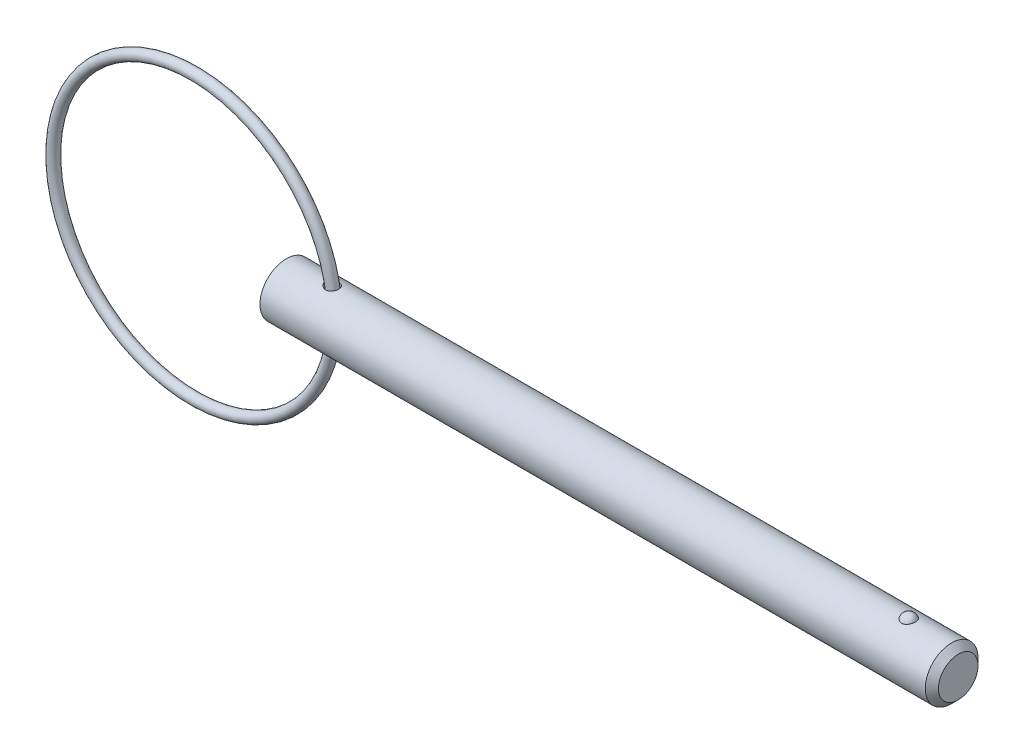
ISO-10303-21;
HEADER;
FILE_DESCRIPTION(('STEP AP214'),'2;1');
FILE_NAME('part.step','',(''),(''),'','','');
FILE_SCHEMA(('AUTOMOTIVE_DESIGN { 1 0 10303 214 1 1 1 1 }'));
ENDSEC;
DATA;
#1=APPLICATION_CONTEXT('core data for automotive mechanical design processes');
#2=APPLICATION_PROTOCOL_DEFINITION('international standard','automotive_design',2000,#1);
#3=PRODUCT_CONTEXT('',#1,'mechanical');
#4=PRODUCT('Part','Part','',(#3));
#5=PRODUCT_RELATED_PRODUCT_CATEGORY('part','',(#4));
#6=PRODUCT_DEFINITION_FORMATION('','',#4);
#7=PRODUCT_DEFINITION_CONTEXT('part definition',#1,'design');
#8=PRODUCT_DEFINITION('design','',#6,#7);
#9=PRODUCT_DEFINITION_SHAPE('','',#8);
#10=(LENGTH_UNIT() NAMED_UNIT(*) SI_UNIT(.MILLI.,.METRE.));
#11=(NAMED_UNIT(*) PLANE_ANGLE_UNIT() SI_UNIT($,.RADIAN.));
#12=(NAMED_UNIT(*) SI_UNIT($,.STERADIAN.) SOLID_ANGLE_UNIT());
#13=UNCERTAINTY_MEASURE_WITH_UNIT(LENGTH_MEASURE(1.E-05),#10,'distance_accuracy_value','');
#14=(GEOMETRIC_REPRESENTATION_CONTEXT(3) GLOBAL_UNCERTAINTY_ASSIGNED_CONTEXT((#13)) GLOBAL_UNIT_ASSIGNED_CONTEXT((#10,
#11,#12)) REPRESENTATION_CONTEXT('',''));
#15=CARTESIAN_POINT('',(0.,0.,0.));
#16=DIRECTION('',(0.,0.,1.));
#17=DIRECTION('',(1.,0.,0.));
#18=AXIS2_PLACEMENT_3D('',#15,#16,#17);
#19=CARTESIAN_POINT('',(-8.3302379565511,0.,0.));
#20=DIRECTION('',(0.,0.,1.));
#21=DIRECTION('',(1.,0.,0.));
#22=AXIS2_PLACEMENT_3D('',#19,#20,#21);
#23=TOROIDAL_SURFACE('',#22,12.7,0.476000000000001);
#24=CARTESIAN_POINT('',(4.8457620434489,0.,0.));
#25=VERTEX_POINT('',#24);
#26=VERTEX_LOOP('',#25);
#27=FACE_BOUND('',#26,.T.);
#28=ADVANCED_FACE('P0_F12',(#27),#23,.T.);
#29=CLOSED_SHELL('',(#28));
#30=MANIFOLD_SOLID_BREP('P0_B1',#29);
#31=CARTESIAN_POINT('',(0.,0.,0.));
#32=DIRECTION('',(1.,0.,0.));
#33=DIRECTION('',(0.,0.,-1.));
#34=AXIS2_PLACEMENT_3D('',#31,#32,#33);
#35=CYLINDRICAL_SURFACE('',#34,2.38);
#36=CARTESIAN_POINT('',(3.67748265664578,2.35074198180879,-0.372037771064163));
#37=CARTESIAN_POINT('',(3.70046616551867,2.34644965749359,-0.399158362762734));
#38=CARTESIAN_POINT('',(3.72581651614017,2.34199234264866,-0.424274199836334));
#39=CARTESIAN_POINT('',(3.78042747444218,2.33326580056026,-0.469907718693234));
#40=CARTESIAN_POINT('',(3.80969342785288,2.32899684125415,-0.490419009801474));
#41=CARTESIAN_POINT('',(3.87128330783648,2.32114904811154,-0.526312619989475));
#42=CARTESIAN_POINT('',(3.90360537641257,2.31756979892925,-0.541698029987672));
#43=CARTESIAN_POINT('',(3.97044528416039,2.31153734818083,-0.566889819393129));
#44=CARTESIAN_POINT('',(4.00496214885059,2.30908365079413,-0.576698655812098));
#45=CARTESIAN_POINT('',(4.07500735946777,2.30564492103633,-0.590297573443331));
#46=CARTESIAN_POINT('',(4.11052759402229,2.30465036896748,-0.594126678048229));
#47=CARTESIAN_POINT('',(4.18170718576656,2.30426876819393,-0.595606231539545));
#48=CARTESIAN_POINT('',(4.21736649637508,2.30488122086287,-0.593258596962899));
#49=CARTESIAN_POINT('',(4.28577822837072,2.30759475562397,-0.582609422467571));
#50=CARTESIAN_POINT('',(4.31858437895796,2.30961492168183,-0.574631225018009));
#51=CARTESIAN_POINT('',(4.38227060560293,2.31483318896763,-0.553233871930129));
#52=CARTESIAN_POINT('',(4.41315097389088,2.31803111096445,-0.539815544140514));
#53=CARTESIAN_POINT('',(4.4711825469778,2.3251225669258,-0.508384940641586));
#54=CARTESIAN_POINT('',(4.49841743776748,2.32899254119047,-0.490521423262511));
#55=CARTESIAN_POINT('',(4.54948265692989,2.33706025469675,-0.450515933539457));
#56=CARTESIAN_POINT('',(4.57331285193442,2.34125800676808,-0.42837379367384));
#57=CARTESIAN_POINT('',(4.61716211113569,2.34956202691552,-0.380209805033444));
#58=CARTESIAN_POINT('',(4.63714543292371,2.35366715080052,-0.354155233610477));
#59=CARTESIAN_POINT('',(4.67254725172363,2.36130301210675,-0.299034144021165));
#60=CARTESIAN_POINT('',(4.68796545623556,2.36483371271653,-0.26996743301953));
#61=CARTESIAN_POINT('',(4.71403776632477,2.37098548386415,-0.209215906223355));
#62=CARTESIAN_POINT('',(4.72462580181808,2.37359383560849,-0.177501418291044));
#63=CARTESIAN_POINT('',(4.7404696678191,2.37755210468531,-0.112692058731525));
#64=CARTESIAN_POINT('',(4.74572552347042,2.37890202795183,-0.0795971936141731));
#65=CARTESIAN_POINT('',(4.75077448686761,2.38019811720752,-0.0129544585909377));
#66=CARTESIAN_POINT('',(4.75056573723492,2.38014380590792,0.0205935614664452));
#67=CARTESIAN_POINT('',(4.74468604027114,2.37863606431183,0.0871753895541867));
#68=CARTESIAN_POINT('',(4.73901506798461,2.37718262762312,0.120209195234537));
#69=CARTESIAN_POINT('',(4.72236472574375,2.37303648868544,0.184779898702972));
#70=CARTESIAN_POINT('',(4.71139268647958,2.37034549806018,0.216318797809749));
#71=CARTESIAN_POINT('',(4.68441400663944,2.36401552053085,0.277063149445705));
#72=CARTESIAN_POINT('',(4.6684071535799,2.36037649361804,0.306268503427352));
#73=CARTESIAN_POINT('',(4.63170627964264,2.35253749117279,0.361595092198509));
#74=CARTESIAN_POINT('',(4.61100040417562,2.34833610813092,0.387708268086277));
#75=CARTESIAN_POINT('',(4.56544852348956,2.33984863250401,0.436017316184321));
#76=CARTESIAN_POINT('',(4.54060272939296,2.33556254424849,0.458213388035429));
#77=CARTESIAN_POINT('',(4.48760111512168,2.32742099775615,0.497916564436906));
#78=CARTESIAN_POINT('',(4.45946763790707,2.32356294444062,0.515452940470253));
#79=CARTESIAN_POINT('',(4.40055109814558,2.31668866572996,0.545520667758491));
#80=CARTESIAN_POINT('',(4.36976845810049,2.31367230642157,0.558052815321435));
#81=CARTESIAN_POINT('',(4.30694930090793,2.30886128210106,0.577633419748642));
#82=CARTESIAN_POINT('',(4.27493988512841,2.30704826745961,0.584764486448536));
#83=CARTESIAN_POINT('',(4.2101455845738,2.30475365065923,0.593744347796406));
#84=CARTESIAN_POINT('',(4.17736068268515,2.30427207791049,0.595593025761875));
#85=CARTESIAN_POINT('',(4.11170515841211,2.30466513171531,0.59406986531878));
#86=CARTESIAN_POINT('',(4.07883545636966,2.30554895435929,0.5906626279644));
#87=CARTESIAN_POINT('',(4.01408593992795,2.30856010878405,0.578780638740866));
#88=CARTESIAN_POINT('',(3.98220636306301,2.31068773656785,0.570304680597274));
#89=CARTESIAN_POINT('',(3.91877258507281,2.31605973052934,0.548090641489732));
#90=CARTESIAN_POINT('',(3.88730095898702,2.31935100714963,0.534128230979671));
#91=CARTESIAN_POINT('',(3.82705133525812,2.32664713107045,0.501391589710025));
#92=CARTESIAN_POINT('',(3.79827429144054,2.33065222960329,0.482615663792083));
#93=CARTESIAN_POINT('',(3.74296348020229,2.3391254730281,0.4397600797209));
#94=CARTESIAN_POINT('',(3.71658313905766,2.3436062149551,0.415484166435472));
#95=CARTESIAN_POINT('',(3.6683951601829,2.35235146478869,0.362706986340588));
#96=CARTESIAN_POINT('',(3.64658727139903,2.35661598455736,0.334205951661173));
#97=CARTESIAN_POINT('',(3.60882605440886,2.36432007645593,0.27436882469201));
#98=CARTESIAN_POINT('',(3.59274982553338,2.36777633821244,0.243112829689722));
#99=CARTESIAN_POINT('',(3.56652169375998,2.3735493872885,0.178112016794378));
#100=CARTESIAN_POINT('',(3.55636536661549,2.3758670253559,0.144369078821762));
#101=CARTESIAN_POINT('',(3.54309691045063,2.37891982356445,0.0783638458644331));
#102=CARTESIAN_POINT('',(3.53947205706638,2.37976992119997,0.0462095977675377));
#103=CARTESIAN_POINT('',(3.53785288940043,2.38014795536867,-0.018248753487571));
#104=CARTESIAN_POINT('',(3.53985756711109,2.37967612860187,-0.0505528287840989));
#105=CARTESIAN_POINT('',(3.54913867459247,2.37752661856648,-0.112617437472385));
#106=CARTESIAN_POINT('',(3.55613538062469,2.37591295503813,-0.142422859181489));
#107=CARTESIAN_POINT('',(3.57477751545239,2.37172196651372,-0.200451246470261));
#108=CARTESIAN_POINT('',(3.5864204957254,2.36914514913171,-0.228675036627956));
#109=CARTESIAN_POINT('',(3.61071901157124,2.36396321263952,-0.276620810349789));
#110=CARTESIAN_POINT('',(3.6225181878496,2.36150235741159,-0.296799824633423));
#111=CARTESIAN_POINT('',(3.64836661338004,2.35629864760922,-0.335619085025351));
#112=CARTESIAN_POINT('',(3.66241608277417,2.353555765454,-0.354259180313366));
#113=CARTESIAN_POINT('',(3.67748265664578,2.35074198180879,-0.372037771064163));
#114=B_SPLINE_CURVE_WITH_KNOTS('',3,(#36,#37,#38,#39,#40,#41,#42,#43,#44,#45,#46,#47,#48,#49,
#50,#51,#52,#53,#54,#55,#56,#57,#58,#59,#60,#61,#62,#63,#64,#65,#66,#67,#68,#69,#70,#71,#72,#73,
#74,#75,#76,#77,#78,#79,#80,#81,#82,#83,#84,#85,#86,#87,#88,#89,#90,#91,#92,#93,#94,#95,#96,#97,
#98,#99,#100,#101,#102,#103,#104,#105,#106,#107,#108,#109,#110,#111,#112,#113),.UNSPECIFIED.,
.T.,.F.,(4,2,2,2,2,2,2,2,2,2,2,2,2,2,2,2,2,2,2,2,2,2,2,2,2,2,2,2,2,2,2,2,2,2,2,2,2,2,4),(0.,
0.107335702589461,0.214819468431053,0.322238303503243,0.429609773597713,0.536277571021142,
0.642912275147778,0.743874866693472,0.844822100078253,0.942762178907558,1.04070609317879,
1.13952022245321,1.23834068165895,1.33847507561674,1.43860899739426,1.53877695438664,
1.63894536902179,1.7389756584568,1.83901017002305,1.93929990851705,2.03958453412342,
2.13922343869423,2.23884648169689,2.33691317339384,2.43498203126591,2.53371427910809,
2.63247003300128,2.73577311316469,2.83911262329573,2.94697761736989,3.05483668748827,
3.16021984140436,3.2655241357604,3.36212700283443,3.45871257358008,3.55027266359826,
3.64178456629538,3.71214035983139,3.78250304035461),.UNSPECIFIED.);
#115=CARTESIAN_POINT('',(3.67748265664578,2.35074198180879,-0.372037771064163));
#116=VERTEX_POINT('',#115);
#117=EDGE_CURVE('P1_E40',#116,#116,#114,.T.);
#118=ORIENTED_EDGE('',*,*,#117,.T.);
#119=EDGE_LOOP('',(#118));
#120=FACE_BOUND('',#119,.T.);
#121=CARTESIAN_POINT('',(60.035,0.,0.));
#122=DIRECTION('',(1.,0.,0.));
#123=DIRECTION('',(0.,0.,-1.));
#124=AXIS2_PLACEMENT_3D('',#121,#122,#123);
#125=CIRCLE('',#124,2.38);
#126=CARTESIAN_POINT('',(60.035,0.,-2.38));
#127=VERTEX_POINT('',#126);
#128=EDGE_CURVE('P1_E25',#127,#127,#125,.T.);
#129=ORIENTED_EDGE('',*,*,#128,.F.);
#130=EDGE_LOOP('',(#129));
#131=FACE_BOUND('',#130,.T.);
#132=CARTESIAN_POINT('',(0.,0.,0.));
#133=DIRECTION('',(1.,0.,0.));
#134=DIRECTION('',(0.,0.,-1.));
#135=AXIS2_PLACEMENT_3D('',#132,#133,#134);
#136=CIRCLE('',#135,2.38);
#137=CARTESIAN_POINT('',(0.,0.,-2.38));
#138=VERTEX_POINT('',#137);
#139=EDGE_CURVE('P1_E9',#138,#138,#136,.T.);
#140=ORIENTED_EDGE('',*,*,#139,.T.);
#141=EDGE_LOOP('',(#140));
#142=FACE_BOUND('',#141,.T.);
#143=CARTESIAN_POINT('',(56.1634492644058,2.2921568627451,0.64063789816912));
#144=CARTESIAN_POINT('',(56.1303559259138,2.29215737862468,0.640637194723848));
#145=CARTESIAN_POINT('',(56.0972546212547,2.29293179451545,0.63788468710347));
#146=CARTESIAN_POINT('',(56.0320176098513,2.29594030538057,0.62696820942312));
#147=CARTESIAN_POINT('',(55.9998823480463,2.29817506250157,0.618801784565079));
#148=CARTESIAN_POINT('',(55.9375402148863,2.30384308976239,0.597351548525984));
#149=CARTESIAN_POINT('',(55.9073305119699,2.30727454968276,0.584075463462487));
#150=CARTESIAN_POINT('',(55.8495674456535,2.31495941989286,0.552829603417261));
#151=CARTESIAN_POINT('',(55.8220141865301,2.31921286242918,0.534859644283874));
#152=CARTESIAN_POINT('',(55.7695938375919,2.32820213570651,0.494282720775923));
#153=CARTESIAN_POINT('',(55.7448050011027,2.33294694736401,0.471576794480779));
#154=CARTESIAN_POINT('',(55.6992169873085,2.34234144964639,0.422446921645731));
#155=CARTESIAN_POINT('',(55.6784185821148,2.34699112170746,0.396022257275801));
#156=CARTESIAN_POINT('',(55.6403580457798,2.35593942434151,0.338855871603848));
#157=CARTESIAN_POINT('',(55.6233051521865,2.36021170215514,0.307970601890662));
#158=CARTESIAN_POINT('',(55.5943607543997,2.3677057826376,0.243750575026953));
#159=CARTESIAN_POINT('',(55.5824701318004,2.37092740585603,0.210415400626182));
#160=CARTESIAN_POINT('',(55.5638076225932,2.37606901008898,0.141189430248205));
#161=CARTESIAN_POINT('',(55.5571956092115,2.37794816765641,0.105252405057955));
#162=CARTESIAN_POINT('',(55.5498095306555,2.38005135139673,0.0327351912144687));
#163=CARTESIAN_POINT('',(55.5490358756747,2.38027526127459,-0.00384504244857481));
#164=CARTESIAN_POINT('',(55.5533628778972,2.37903842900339,-0.076983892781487));
#165=CARTESIAN_POINT('',(55.5585202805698,2.37756141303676,-0.113538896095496));
#166=CARTESIAN_POINT('',(55.5747013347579,2.37305303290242,-0.185229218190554));
#167=CARTESIAN_POINT('',(55.5857251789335,2.37002161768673,-0.220364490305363));
#168=CARTESIAN_POINT('',(55.6133977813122,2.36273722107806,-0.288156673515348));
#169=CARTESIAN_POINT('',(55.6300389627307,2.35848588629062,-0.320816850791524));
#170=CARTESIAN_POINT('',(55.6685984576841,2.34923130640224,-0.382744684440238));
#171=CARTESIAN_POINT('',(55.690516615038,2.34422808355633,-0.41201244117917));
#172=CARTESIAN_POINT('',(55.7387549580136,2.33412555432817,-0.46583000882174));
#173=CARTESIAN_POINT('',(55.7650028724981,2.32902887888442,-0.490444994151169));
#174=CARTESIAN_POINT('',(55.8214769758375,2.31926941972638,-0.534700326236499));
#175=CARTESIAN_POINT('',(55.851702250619,2.3146065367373,-0.554341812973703));
#176=CARTESIAN_POINT('',(55.9140618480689,2.30645675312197,-0.587312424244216));
#177=CARTESIAN_POINT('',(55.9460780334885,2.30293152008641,-0.600855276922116));
#178=CARTESIAN_POINT('',(56.0120795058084,2.29725171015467,-0.622220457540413));
#179=CARTESIAN_POINT('',(56.0460641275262,2.29509667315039,-0.630044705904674));
#180=CARTESIAN_POINT('',(56.113299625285,2.29249264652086,-0.639452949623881));
#181=CARTESIAN_POINT('',(56.1465087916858,2.29196755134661,-0.641315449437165));
#182=CARTESIAN_POINT('',(56.212763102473,2.29246849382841,-0.639522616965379));
#183=CARTESIAN_POINT('',(56.2458082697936,2.29349430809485,-0.635868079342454));
#184=CARTESIAN_POINT('',(56.3101025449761,2.29694059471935,-0.623301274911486));
#185=CARTESIAN_POINT('',(56.3413744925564,2.29933234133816,-0.614497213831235));
#186=CARTESIAN_POINT('',(56.4019952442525,2.30522511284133,-0.592006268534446));
#187=CARTESIAN_POINT('',(56.4313438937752,2.30872622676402,-0.578318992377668));
#188=CARTESIAN_POINT('',(56.4880369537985,2.31655795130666,-0.546112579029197));
#189=CARTESIAN_POINT('',(56.515320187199,2.32090569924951,-0.527490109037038));
#190=CARTESIAN_POINT('',(56.5664904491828,2.32992206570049,-0.486117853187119));
#191=CARTESIAN_POINT('',(56.5903767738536,2.33459075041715,-0.46336721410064));
#192=CARTESIAN_POINT('',(56.6352722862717,2.34399834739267,-0.413220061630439));
#193=CARTESIAN_POINT('',(56.6560972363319,2.34873051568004,-0.3856573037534));
#194=CARTESIAN_POINT('',(56.693056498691,2.35754932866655,-0.327455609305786));
#195=CARTESIAN_POINT('',(56.7091898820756,2.36163584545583,-0.296816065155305));
#196=CARTESIAN_POINT('',(56.7369822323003,2.36889321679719,-0.232047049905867));
#197=CARTESIAN_POINT('',(56.7484450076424,2.37202275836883,-0.197828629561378));
#198=CARTESIAN_POINT('',(56.7657523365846,2.37681926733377,-0.12790042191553));
#199=CARTESIAN_POINT('',(56.7715962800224,2.37848607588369,-0.0921904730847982));
#200=CARTESIAN_POINT('',(56.777605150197,2.38020024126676,-0.0196348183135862));
#201=CARTESIAN_POINT('',(56.7776704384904,2.38021918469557,0.0172198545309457));
#202=CARTESIAN_POINT('',(56.7718689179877,2.37856356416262,0.0904219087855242));
#203=CARTESIAN_POINT('',(56.7660018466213,2.37688892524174,0.126769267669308));
#204=CARTESIAN_POINT('',(56.748425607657,2.37201688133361,0.198028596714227));
#205=CARTESIAN_POINT('',(56.736699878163,2.36881516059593,0.232936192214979));
#206=CARTESIAN_POINT('',(56.7076354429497,2.36123444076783,0.300196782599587));
#207=CARTESIAN_POINT('',(56.6902967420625,2.3568554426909,0.332549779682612));
#208=CARTESIAN_POINT('',(56.6505350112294,2.34744667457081,0.393495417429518));
#209=CARTESIAN_POINT('',(56.6281528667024,2.34242227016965,0.422115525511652));
#210=CARTESIAN_POINT('',(56.5787391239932,2.33227293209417,0.4750047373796));
#211=CARTESIAN_POINT('',(56.5517076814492,2.32714800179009,0.499273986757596));
#212=CARTESIAN_POINT('',(56.4944988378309,2.31755359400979,0.542046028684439));
#213=CARTESIAN_POINT('',(56.4644297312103,2.3130698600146,0.56069032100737));
#214=CARTESIAN_POINT('',(56.4013869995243,2.30514125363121,0.592447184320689));
#215=CARTESIAN_POINT('',(56.3684158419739,2.30169550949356,0.60556440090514));
#216=CARTESIAN_POINT('',(56.3068424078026,2.29677744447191,0.623927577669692));
#217=CARTESIAN_POINT('',(56.2785555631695,2.29505839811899,0.630178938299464));
#218=CARTESIAN_POINT('',(56.2213308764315,2.29274795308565,0.638534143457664));
#219=CARTESIAN_POINT('',(56.1923931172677,2.29215641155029,0.640638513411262));
#220=CARTESIAN_POINT('',(56.1634492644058,2.2921568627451,0.64063789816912));
#221=B_SPLINE_CURVE_WITH_KNOTS('',3,(#143,#144,#145,#146,#147,#148,#149,#150,#151,#152,#153,
#154,#155,#156,#157,#158,#159,#160,#161,#162,#163,#164,#165,#166,#167,#168,#169,#170,#171,#172,
#173,#174,#175,#176,#177,#178,#179,#180,#181,#182,#183,#184,#185,#186,#187,#188,#189,#190,#191,
#192,#193,#194,#195,#196,#197,#198,#199,#200,#201,#202,#203,#204,#205,#206,#207,#208,#209,#210,
#211,#212,#213,#214,#215,#216,#217,#218,#219,#220),.UNSPECIFIED.,.T.,.F.,(4,2,2,2,2,2,2,2,2,2,2,
2,2,2,2,2,2,2,2,2,2,2,2,2,2,2,2,2,2,2,2,2,2,2,2,2,2,2,4),(0.,0.0991724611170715,
0.198389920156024,0.297457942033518,0.396529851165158,0.49792776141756,0.599345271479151,
0.705475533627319,0.811623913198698,0.920876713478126,1.03013718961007,1.14045177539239,
1.25076998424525,1.36093998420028,1.47110672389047,1.57959248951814,1.68805336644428,
1.79234266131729,1.89659691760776,1.99590391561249,2.09519661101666,2.19247425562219,
2.28975970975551,2.38926978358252,2.48880044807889,2.59293588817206,2.69709193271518,
2.80525821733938,2.91343624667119,3.02347917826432,3.13352698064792,3.24388765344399,
3.35424823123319,3.46374443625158,3.57323697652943,3.67968690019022,3.78604717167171,
3.87279565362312,3.95953314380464),.UNSPECIFIED.);
#222=CARTESIAN_POINT('',(56.1634492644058,2.2921568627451,0.64063789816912));
#223=VERTEX_POINT('',#222);
#224=EDGE_CURVE('P1_E34',#223,#223,#221,.T.);
#225=ORIENTED_EDGE('',*,*,#224,.T.);
#226=EDGE_LOOP('',(#225));
#227=FACE_BOUND('',#226,.T.);
#228=CARTESIAN_POINT('',(3.67748265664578,-2.35074198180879,-0.372037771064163));
#229=CARTESIAN_POINT('',(3.65652023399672,-2.35465684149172,-0.34730037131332));
#230=CARTESIAN_POINT('',(3.6375132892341,-2.35843676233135,-0.320880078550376));
#231=CARTESIAN_POINT('',(3.60404107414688,-2.36534227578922,-0.265218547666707));
#232=CARTESIAN_POINT('',(3.58957485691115,-2.36846800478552,-0.235977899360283));
#233=CARTESIAN_POINT('',(3.56572865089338,-2.37373250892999,-0.17528149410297));
#234=CARTESIAN_POINT('',(3.55636565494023,-2.37586798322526,-0.143818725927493));
#235=CARTESIAN_POINT('',(3.54325775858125,-2.37888184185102,-0.0796854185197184));
#236=CARTESIAN_POINT('',(3.53951093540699,-2.37976065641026,-0.047015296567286));
#237=CARTESIAN_POINT('',(3.537872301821,-2.38014359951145,0.0167788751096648));
#238=CARTESIAN_POINT('',(3.53968714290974,-2.37971660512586,0.0478953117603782));
#239=CARTESIAN_POINT('',(3.54844977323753,-2.37768530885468,0.10935299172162));
#240=CARTESIAN_POINT('',(3.55539746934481,-2.37608102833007,0.139694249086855));
#241=CARTESIAN_POINT('',(3.57400783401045,-2.37189301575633,0.198451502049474));
#242=CARTESIAN_POINT('',(3.58561918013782,-2.36931996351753,0.226884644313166));
#243=CARTESIAN_POINT('',(3.61310377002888,-2.36345094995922,0.281524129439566));
#244=CARTESIAN_POINT('',(3.62897804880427,-2.36015481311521,0.307729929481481));
#245=CARTESIAN_POINT('',(3.66562367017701,-2.35291979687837,0.359001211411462));
#246=CARTESIAN_POINT('',(3.68664499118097,-2.34895316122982,0.38388386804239));
#247=CARTESIAN_POINT('',(3.73230875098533,-2.34094029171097,0.430056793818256));
#248=CARTESIAN_POINT('',(3.75695270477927,-2.33689402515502,0.451345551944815));
#249=CARTESIAN_POINT('',(3.81128123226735,-2.32880869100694,0.491427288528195));
#250=CARTESIAN_POINT('',(3.84120889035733,-2.32479472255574,0.509896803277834));
#251=CARTESIAN_POINT('',(3.90376464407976,-2.31758417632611,0.541729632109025));
#252=CARTESIAN_POINT('',(3.93639323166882,-2.31438774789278,0.555092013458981));
#253=CARTESIAN_POINT('',(4.00416670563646,-2.30915137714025,0.576493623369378));
#254=CARTESIAN_POINT('',(4.03934856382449,-2.30713552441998,0.584422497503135));
#255=CARTESIAN_POINT('',(4.11060438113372,-2.30465258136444,0.594140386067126));
#256=CARTESIAN_POINT('',(4.14667802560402,-2.30418495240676,0.595931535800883));
#257=CARTESIAN_POINT('',(4.21693481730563,-2.30488473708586,0.593218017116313));
#258=CARTESIAN_POINT('',(4.25112951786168,-2.30597897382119,0.588995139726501));
#259=CARTESIAN_POINT('',(4.31821509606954,-2.30956729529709,0.57476284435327));
#260=CARTESIAN_POINT('',(4.35110629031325,-2.31206103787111,0.564754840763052));
#261=CARTESIAN_POINT('',(4.41316900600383,-2.31802118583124,0.53975368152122));
#262=CARTESIAN_POINT('',(4.44243993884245,-2.32144077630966,0.524995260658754));
#263=CARTESIAN_POINT('',(4.49802365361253,-2.32890801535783,0.490807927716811));
#264=CARTESIAN_POINT('',(4.52433643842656,-2.33295566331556,0.471379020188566));
#265=CARTESIAN_POINT('',(4.57327790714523,-2.3412242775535,0.428422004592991));
#266=CARTESIAN_POINT('',(4.59591094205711,-2.34544503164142,0.404898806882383));
#267=CARTESIAN_POINT('',(4.63697038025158,-2.35360640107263,0.354387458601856));
#268=CARTESIAN_POINT('',(4.65539647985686,-2.35754699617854,0.327399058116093));
#269=CARTESIAN_POINT('',(4.68784943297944,-2.36478461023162,0.270249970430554));
#270=CARTESIAN_POINT('',(4.70180333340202,-2.36807065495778,0.240046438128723));
#271=CARTESIAN_POINT('',(4.72457181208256,-2.3735656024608,0.177668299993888));
#272=CARTESIAN_POINT('',(4.73338630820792,-2.37577448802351,0.145493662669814));
#273=CARTESIAN_POINT('',(4.74568442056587,-2.37888446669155,0.0799353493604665));
#274=CARTESIAN_POINT('',(4.74914498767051,-2.37977990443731,0.0465470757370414));
#275=CARTESIAN_POINT('',(4.75057509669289,-2.38014803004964,-0.0203543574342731));
#276=CARTESIAN_POINT('',(4.74854468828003,-2.37962073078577,-0.0538675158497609));
#277=CARTESIAN_POINT('',(4.73905606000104,-2.37720346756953,-0.119981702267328));
#278=CARTESIAN_POINT('',(4.73161109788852,-2.37531683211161,-0.152584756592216));
#279=CARTESIAN_POINT('',(4.71149336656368,-2.37038779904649,-0.21604453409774));
#280=CARTESIAN_POINT('',(4.69882040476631,-2.36734535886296,-0.246901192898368));
#281=CARTESIAN_POINT('',(4.66852750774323,-2.3604270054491,-0.306062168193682));
#282=CARTESIAN_POINT('',(4.65089743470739,-2.35654938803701,-0.334361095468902));
#283=CARTESIAN_POINT('',(4.61113860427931,-2.34839114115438,-0.387535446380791));
#284=CARTESIAN_POINT('',(4.58900985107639,-2.34411051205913,-0.412410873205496));
#285=CARTESIAN_POINT('',(4.54086484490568,-2.33563475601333,-0.457982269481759));
#286=CARTESIAN_POINT('',(4.51485596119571,-2.33143948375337,-0.478685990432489));
#287=CARTESIAN_POINT('',(4.45962330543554,-2.32360655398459,-0.515369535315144));
#288=CARTESIAN_POINT('',(4.43040000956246,-2.31996881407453,-0.53135005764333));
#289=CARTESIAN_POINT('',(4.37002624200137,-2.31371771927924,-0.557938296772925));
#290=CARTESIAN_POINT('',(4.33891082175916,-2.31108995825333,-0.56862225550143));
#291=CARTESIAN_POINT('',(4.27527207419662,-2.30707117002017,-0.584715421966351));
#292=CARTESIAN_POINT('',(4.24274884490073,-2.30568005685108,-0.590124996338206));
#293=CARTESIAN_POINT('',(4.17738918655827,-2.30427145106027,-0.595601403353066));
#294=CARTESIAN_POINT('',(4.14455499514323,-2.3042474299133,-0.595693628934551));
#295=CARTESIAN_POINT('',(4.07930726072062,-2.30552664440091,-0.590722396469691));
#296=CARTESIAN_POINT('',(4.0468938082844,-2.3068301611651,-0.585657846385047));
#297=CARTESIAN_POINT('',(3.98220150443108,-2.31066076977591,-0.570360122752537));
#298=CARTESIAN_POINT('',(3.94996602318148,-2.31322859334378,-0.559954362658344));
#299=CARTESIAN_POINT('',(3.88760707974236,-2.31930140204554,-0.534242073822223));
#300=CARTESIAN_POINT('',(3.85748403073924,-2.32280656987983,-0.518934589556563));
#301=CARTESIAN_POINT('',(3.80033132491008,-2.33034138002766,-0.483968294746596));
#302=CARTESIAN_POINT('',(3.77327623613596,-2.33436601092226,-0.464349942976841));
#303=CARTESIAN_POINT('',(3.72262060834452,-2.34255524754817,-0.421092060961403));
#304=CARTESIAN_POINT('',(3.69901956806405,-2.34671983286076,-0.397453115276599));
#305=CARTESIAN_POINT('',(3.67748265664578,-2.35074198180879,-0.372037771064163));
#306=B_SPLINE_CURVE_WITH_KNOTS('',3,(#228,#229,#230,#231,#232,#233,#234,#235,#236,#237,#238,
#239,#240,#241,#242,#243,#244,#245,#246,#247,#248,#249,#250,#251,#252,#253,#254,#255,#256,#257,
#258,#259,#260,#261,#262,#263,#264,#265,#266,#267,#268,#269,#270,#271,#272,#273,#274,#275,#276,
#277,#278,#279,#280,#281,#282,#283,#284,#285,#286,#287,#288,#289,#290,#291,#292,#293,#294,#295,
#296,#297,#298,#299,#300,#301,#302,#303,#304,#305),.UNSPECIFIED.,.T.,.F.,(4,2,2,2,2,2,2,2,2,2,2,
2,2,2,2,2,2,2,2,2,2,2,2,2,2,2,2,2,2,2,2,2,2,2,2,2,2,2,4),(0.,0.09787553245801,0.19573064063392,
0.293909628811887,0.39205499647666,0.485114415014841,0.578172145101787,0.670232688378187,
0.762315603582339,0.860342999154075,0.958411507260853,1.06411708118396,1.16984195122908,
1.27765506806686,1.38543067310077,1.48831936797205,1.59118291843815,1.68959047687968,
1.78799793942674,1.88628818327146,1.98458551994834,2.08441314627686,2.18424236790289,
2.28450017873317,2.3847570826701,2.4847693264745,2.58478525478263,2.68500723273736,
2.78522911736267,2.8852630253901,2.98528213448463,3.08381637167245,3.18234375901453,
3.28040059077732,3.37847819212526,3.47994551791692,3.58143263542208,3.68200512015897,
3.78256299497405),.UNSPECIFIED.);
#307=CARTESIAN_POINT('',(3.67748265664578,-2.35074198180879,-0.372037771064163));
#308=VERTEX_POINT('',#307);
#309=EDGE_CURVE('P1_E17',#308,#308,#306,.T.);
#310=ORIENTED_EDGE('',*,*,#309,.T.);
#311=EDGE_LOOP('',(#310));
#312=FACE_BOUND('',#311,.T.);
#313=ADVANCED_FACE('P1_F13',(#120,#131,#142,#227,#312),#35,.T.);
#314=CARTESIAN_POINT('',(0.,0.,0.));
#315=DIRECTION('',(-1.,0.,0.));
#316=DIRECTION('',(0.,0.,1.));
#317=AXIS2_PLACEMENT_3D('',#314,#315,#316);
#318=PLANE('',#317);
#319=ORIENTED_EDGE('',*,*,#139,.F.);
#320=EDGE_LOOP('',(#319));
#321=FACE_BOUND('',#320,.T.);
#322=ADVANCED_FACE('P1_F15',(#321),#318,.T.);
#323=CARTESIAN_POINT('',(60.63,0.,0.));
#324=DIRECTION('',(-1.,0.,0.));
#325=DIRECTION('',(0.,0.,1.));
#326=AXIS2_PLACEMENT_3D('',#323,#324,#325);
#327=CONICAL_SURFACE('',#326,1.78500000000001,0.78539816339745);
#328=ORIENTED_EDGE('',*,*,#128,.T.);
#329=EDGE_LOOP('',(#328));
#330=FACE_BOUND('',#329,.T.);
#331=CARTESIAN_POINT('',(60.63,0.,0.));
#332=DIRECTION('',(1.,0.,0.));
#333=DIRECTION('',(0.,0.,-1.));
#334=AXIS2_PLACEMENT_3D('',#331,#332,#333);
#335=CIRCLE('',#334,1.78500000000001);
#336=CARTESIAN_POINT('',(60.63,0.,-1.78500000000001));
#337=VERTEX_POINT('',#336);
#338=EDGE_CURVE('P1_E30',#337,#337,#335,.T.);
#339=ORIENTED_EDGE('',*,*,#338,.F.);
#340=EDGE_LOOP('',(#339));
#341=FACE_BOUND('',#340,.T.);
#342=ADVANCED_FACE('P1_F55',(#330,#341),#327,.T.);
#343=CARTESIAN_POINT('',(60.63,1.78500000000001,0.));
#344=DIRECTION('',(1.,0.,0.));
#345=DIRECTION('',(0.,0.,-1.));
#346=AXIS2_PLACEMENT_3D('',#343,#344,#345);
#347=PLANE('',#346);
#348=ORIENTED_EDGE('',*,*,#338,.T.);
#349=EDGE_LOOP('',(#348));
#350=FACE_BOUND('',#349,.T.);
#351=ADVANCED_FACE('P1_F51',(#350),#347,.T.);
#352=CARTESIAN_POINT('',(56.1634492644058,2.142,0.));
#353=DIRECTION('',(-1.,0.,0.));
#354=DIRECTION('',(0.,-1.,0.));
#355=AXIS2_PLACEMENT_3D('',#352,#353,#354);
#356=SPHERICAL_SURFACE('',#355,0.657999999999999);
#357=ORIENTED_EDGE('',*,*,#224,.F.);
#358=EDGE_LOOP('',(#357));
#359=FACE_BOUND('',#358,.T.);
#360=ADVANCED_FACE('P1_F46',(#359),#356,.T.);
#361=CARTESIAN_POINT('',(-8.3302379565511,0.,0.));
#362=DIRECTION('',(0.,0.,1.));
#363=DIRECTION('',(1.,0.,0.));
#364=AXIS2_PLACEMENT_3D('',#361,#362,#363);
#365=TOROIDAL_SURFACE('',#364,12.7,0.594999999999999);
#366=ORIENTED_EDGE('',*,*,#309,.F.);
#367=EDGE_LOOP('',(#366));
#368=FACE_BOUND('',#367,.T.);
#369=ORIENTED_EDGE('',*,*,#117,.F.);
#370=EDGE_LOOP('',(#369));
#371=FACE_BOUND('',#370,.T.);
#372=ADVANCED_FACE('P1_F50',(#368,#371),#365,.F.);
#373=CLOSED_SHELL('',(#313,#322,#342,#351,#360,#372));
#374=MANIFOLD_SOLID_BREP('P1_B1',#373);
#375=ADVANCED_BREP_SHAPE_REPRESENTATION('',(#18,#30,#374),#14);
#376=SHAPE_DEFINITION_REPRESENTATION(#9,#375);
ENDSEC;
END-ISO-10303-21;
